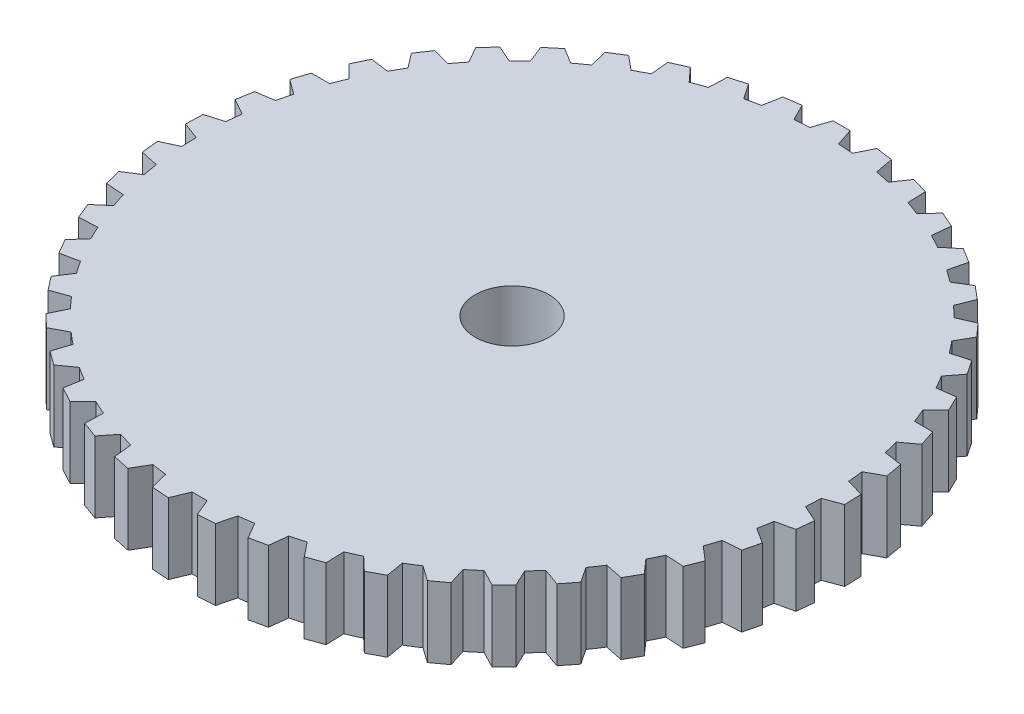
from build123d import *

# Parameters (mm, degrees)
SKETCH1_R           = 13.97
BOSS_EXTRUDE1_DEPTH = 3.175
BOSS_EXTRUDE2_DEPTH = 3.175
SKETCH3_R           = 1.651
CUT_EXTRUDE1_DEPTH  = 3.175


with BuildPart() as part:
    # Sketch1 → Boss-Extrude1 (new body)
    with BuildSketch(Plane(origin=(0, 0, 0), x_dir=(1, 0, 0), z_dir=(0, 1, 0))):
        with Locations(Location((0, 0, 0), (0, 0, 270))):
            Circle(SKETCH1_R)
    extrude(amount=BOSS_EXTRUDE1_DEPTH)

    # Sketch2 → Boss-Extrude2 (add)
    with BuildSketch(Plane(origin=(0, 3.175, 0), x_dir=(1, 0, 0), z_dir=(0, 1, 0))):
        Polygon((1.673005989, 14.64165414), (2.427590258, 14.535604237), (2.645807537, 13.350702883), (1.136639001, 13.562802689), align=None)
        Polygon((-0.762, 13.589), (0.762, 13.589), (0.381, 14.732), (-0.381, 14.732), align=None)
        Polygon((3.69444882, 14.266325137), (4.426930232, 14.056289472), (4.478117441, 12.852549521), (3.013154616, 13.272620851), align=None)
        Polygon((5.643983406, 13.613318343), (6.340105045, 13.303385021), (6.223265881, 12.104235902), (4.831022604, 12.724102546), align=None)
        Polygon((7.483664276, 12.695343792), (8.129876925, 12.291545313), (7.847285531, 11.120327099), (6.554860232, 11.927924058), align=None)
        Polygon((9.177684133, 11.530268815), (9.761409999, 11.040464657), (9.318566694, 9.919973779), (8.151114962, 10.899582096), align=None)
        Polygon((10.693070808, 10.140770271), (11.20294833, 9.574493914), (10.608472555, 8.526539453), (9.588717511, 9.659092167), align=None)
        Polygon((12.000329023, 8.553893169), (12.426434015, 7.922166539), (11.691896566, 6.967145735), (10.839686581, 8.230598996), align=None)
        Polygon((13.074014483, 6.800524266), (13.408053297, 6.115643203), (12.547751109, 5.27214445), (11.879673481, 6.641906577), align=None)
        Polygon((13.893229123, 4.914790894), (14.128700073, 4.190085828), (13.15937795, 3.474526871), (12.68843605, 4.923937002), align=None)
        Polygon((14.442027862, 2.933396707), (14.574347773, 2.182973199), (13.514872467, 1.609281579), (13.250232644, 3.110128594), align=None)
        Polygon((14.709728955, 0.894907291), (14.736322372, 0.13337148), (13.607315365, -0.287286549), (13.554128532, 1.235785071), align=None)
        Polygon((14.691121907, -1.161000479), (14.611471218, -1.918826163), (13.434907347, -2.178262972), (13.594208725, -0.662611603), align=None)
        Polygon((14.386568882, -3.194310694), (14.202224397, -3.933676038), (13.00100414, -4.026841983), (13.369693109, -2.548111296), align=None)
        Polygon((13.801997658, -5.165447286), (13.516547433, -5.871961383), (12.314051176, -5.797043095), (12.884951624, -4.384014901), align=None)
        Polygon((12.948786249, -7.036044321), (12.567786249, -7.695955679), (11.387419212, -7.454411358), (12.149419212, -6.134588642), align=None)
        Polygon((11.843541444, -8.769692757), (11.3744074, -9.370156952), (10.239144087, -8.966687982), (11.177412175, -7.765759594), align=None)
        Polygon((10.507775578, -10.332649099), (9.95963865, -10.861978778), (8.891575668, -10.304438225), (9.987849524, -9.245778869), align=None)
        Polygon((8.967487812, -11.69449218), (8.351016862, -12.142384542), (7.370942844, -11.441624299), (8.603884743, -10.545839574), align=None)
        Polygon((7.252658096, -12.828715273), (6.57985203, -13.186452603), (5.706843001, -12.35611217), (7.052455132, -11.640637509), align=None)
        Polygon((5.39666364, -13.713242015), (4.680617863, -13.973861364), (3.931665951, -13.030102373), (5.363757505, -12.508863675), align=None)
        Polygon((3.435629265, -14.3308561), (2.690280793, -14.489284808), (2.079963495, -13.450476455), (3.570660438, -13.133619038), align=None)
        Polygon((1.407724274, -14.669536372), (0.647580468, -14.722690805), (0.187776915, -13.609052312), (1.708064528, -13.502743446), align=None)
        Polygon((-0.647580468, -14.722690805), (-1.407724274, -14.669536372), (-1.708064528, -13.502743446), (-0.187776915, -13.609052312), align=None)
        Polygon((-2.690280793, -14.489284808), (-3.435629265, -14.3308561), (-3.570660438, -13.133619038), (-2.079963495, -13.450476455), align=None)
        Polygon((-4.680617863, -13.973861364), (-5.39666364, -13.713242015), (-5.363757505, -12.508863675), (-3.931665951, -13.030102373), align=None)
        Polygon((-6.57985203, -13.186452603), (-7.252658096, -12.828715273), (-7.052455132, -11.640637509), (-5.706843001, -12.35611217), align=None)
        Polygon((-8.351016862, -12.142384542), (-8.967487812, -11.69449218), (-8.603884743, -10.545839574), (-7.370942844, -11.441624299), align=None)
        Polygon((-9.95963865, -10.861978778), (-10.507775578, -10.332649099), (-9.987849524, -9.245778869), (-8.891575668, -10.304438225), align=None)
        Polygon((-11.3744074, -9.370156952), (-11.843541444, -8.769692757), (-11.177412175, -7.765759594), (-10.239144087, -8.966687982), align=None)
        Polygon((-12.567786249, -7.695955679), (-12.948786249, -7.036044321), (-12.149419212, -6.134588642), (-11.387419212, -7.454411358), align=None)
        Polygon((-13.516547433, -5.871961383), (-13.801997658, -5.165447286), (-12.884951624, -4.384014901), (-12.314051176, -5.797043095), align=None)
        Polygon((-14.202224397, -3.933676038), (-14.386568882, -3.194310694), (-13.369693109, -2.548111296), (-13.00100414, -4.026841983), align=None)
        Polygon((-14.611471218, -1.918826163), (-14.691121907, -1.161000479), (-13.594208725, -0.662611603), (-13.434907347, -2.178262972), align=None)
        Polygon((-14.736322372, 0.13337148), (-14.709728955, 0.894907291), (-13.554128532, 1.235785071), (-13.607315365, -0.287286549), align=None)
        Polygon((-14.574347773, 2.182973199), (-14.442027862, 2.933396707), (-13.250232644, 3.110128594), (-13.514872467, 1.609281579), align=None)
        Polygon((-14.128700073, 4.190085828), (-13.893229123, 4.914790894), (-12.68843605, 4.923937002), (-13.15937795, 3.474526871), align=None)
        Polygon((-13.408053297, 6.115643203), (-13.074014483, 6.800524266), (-11.879673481, 6.641906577), (-12.547751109, 5.27214445), align=None)
        Polygon((-12.426434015, 7.922166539), (-12.000329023, 8.553893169), (-10.839686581, 8.230598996), (-11.691896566, 6.967145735), align=None)
        Polygon((-11.20294833, 9.574493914), (-10.693070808, 10.140770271), (-9.588717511, 9.659092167), (-10.608472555, 8.526539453), align=None)
        Polygon((-9.761409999, 11.040464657), (-9.177684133, 11.530268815), (-8.151114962, 10.899582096), (-9.318566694, 9.919973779), align=None)
        Polygon((-8.129876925, 12.291545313), (-7.483664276, 12.695343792), (-6.554860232, 11.927924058), (-7.847285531, 11.120327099), align=None)
        Polygon((-6.340105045, 13.303385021), (-5.643983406, 13.613318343), (-4.831022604, 12.724102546), (-6.223265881, 12.104235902), align=None)
        Polygon((-4.426930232, 14.056289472), (-3.69444882, 14.266325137), (-3.013154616, 13.272620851), (-4.478117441, 12.852549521), align=None)
        Polygon((-2.427590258, 14.535604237), (-1.673005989, 14.64165414), (-1.136639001, 13.562802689), (-2.645807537, 13.350702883), align=None)
    extrude(amount=-BOSS_EXTRUDE2_DEPTH)

    # Sketch3 → Cut-Extrude1 (cut)
    with BuildSketch(Plane(origin=(0, 3.175, 0), x_dir=(1, 0, 0), z_dir=(0, 1, 0))):
        with Locations(Location((0, 0, 0), (0, 0, 270))):
            Circle(SKETCH3_R)
    extrude(amount=-CUT_EXTRUDE1_DEPTH, mode=Mode.SUBTRACT)


solid = part.part
